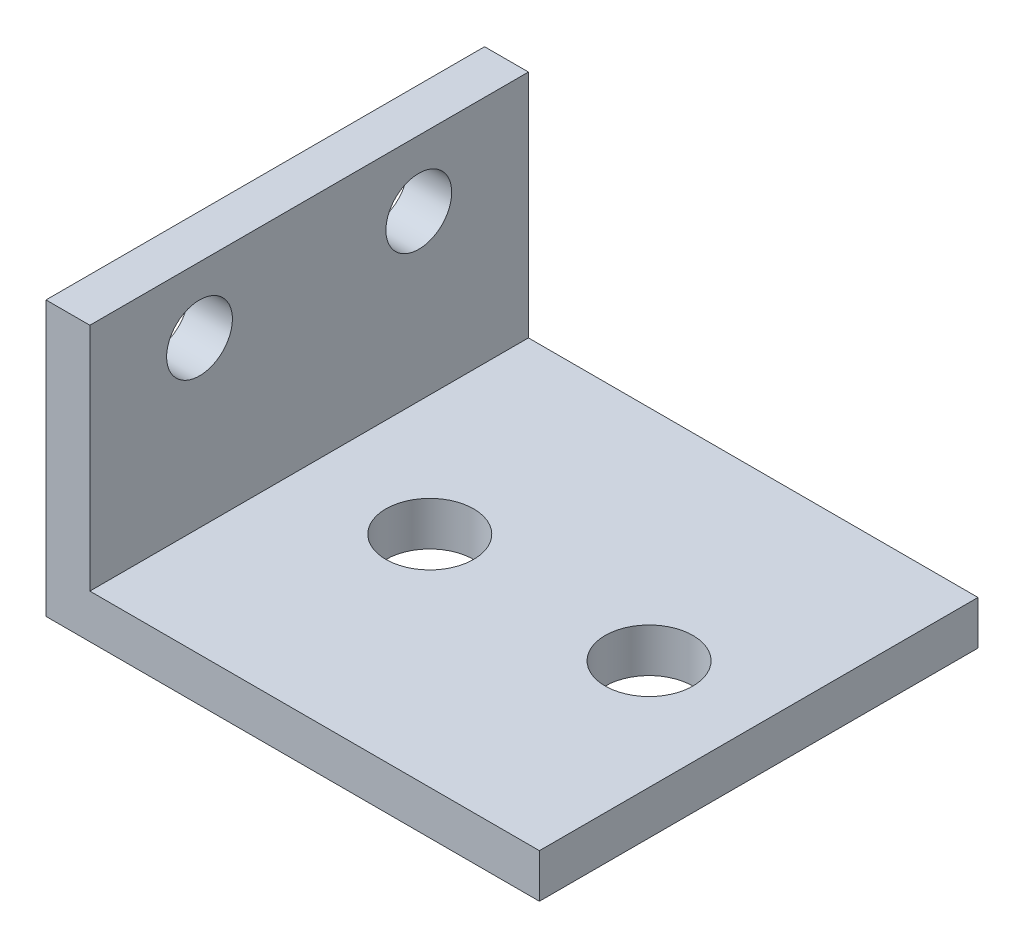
ISO-10303-21;
HEADER;
FILE_DESCRIPTION(('STEP AP214'),'2;1');
FILE_NAME('part.step','',(''),(''),'','','');
FILE_SCHEMA(('AUTOMOTIVE_DESIGN { 1 0 10303 214 1 1 1 1 }'));
ENDSEC;
DATA;
#1=APPLICATION_CONTEXT('core data for automotive mechanical design processes');
#2=APPLICATION_PROTOCOL_DEFINITION('international standard','automotive_design',2000,#1);
#3=PRODUCT_CONTEXT('',#1,'mechanical');
#4=PRODUCT('Part','Part','',(#3));
#5=PRODUCT_RELATED_PRODUCT_CATEGORY('part','',(#4));
#6=PRODUCT_DEFINITION_FORMATION('','',#4);
#7=PRODUCT_DEFINITION_CONTEXT('part definition',#1,'design');
#8=PRODUCT_DEFINITION('design','',#6,#7);
#9=PRODUCT_DEFINITION_SHAPE('','',#8);
#10=(LENGTH_UNIT() NAMED_UNIT(*) SI_UNIT(.MILLI.,.METRE.));
#11=(NAMED_UNIT(*) PLANE_ANGLE_UNIT() SI_UNIT($,.RADIAN.));
#12=(NAMED_UNIT(*) SI_UNIT($,.STERADIAN.) SOLID_ANGLE_UNIT());
#13=UNCERTAINTY_MEASURE_WITH_UNIT(LENGTH_MEASURE(1.E-05),#10,'distance_accuracy_value','');
#14=(GEOMETRIC_REPRESENTATION_CONTEXT(3) GLOBAL_UNCERTAINTY_ASSIGNED_CONTEXT((#13)) GLOBAL_UNIT_ASSIGNED_CONTEXT((#10,
#11,#12)) REPRESENTATION_CONTEXT('',''));
#15=CARTESIAN_POINT('',(0.,0.,0.));
#16=DIRECTION('',(0.,0.,1.));
#17=DIRECTION('',(1.,0.,0.));
#18=AXIS2_PLACEMENT_3D('',#15,#16,#17);
#19=CARTESIAN_POINT('',(45.,0.,40.));
#20=DIRECTION('',(0.,1.,0.));
#21=DIRECTION('',(-1.,0.,0.));
#22=AXIS2_PLACEMENT_3D('',#19,#20,#21);
#23=PLANE('',#22);
#24=CARTESIAN_POINT('',(35.,0.,20.));
#25=DIRECTION('',(0.,1.,0.));
#26=DIRECTION('',(-1.,0.,0.));
#27=AXIS2_PLACEMENT_3D('',#24,#25,#26);
#28=CIRCLE('',#27,4.00000000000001);
#29=CARTESIAN_POINT('',(31.,0.,20.));
#30=VERTEX_POINT('',#29);
#31=EDGE_CURVE('E179',#30,#30,#28,.T.);
#32=ORIENTED_EDGE('',*,*,#31,.T.);
#33=EDGE_LOOP('',(#32));
#34=FACE_BOUND('',#33,.T.);
#35=CARTESIAN_POINT('',(15.,0.,20.));
#36=DIRECTION('',(0.,1.,0.));
#37=DIRECTION('',(-1.,0.,0.));
#38=AXIS2_PLACEMENT_3D('',#35,#36,#37);
#39=CIRCLE('',#38,4.);
#40=CARTESIAN_POINT('',(11.,0.,20.));
#41=VERTEX_POINT('',#40);
#42=EDGE_CURVE('E182',#41,#41,#39,.T.);
#43=ORIENTED_EDGE('',*,*,#42,.T.);
#44=EDGE_LOOP('',(#43));
#45=FACE_BOUND('',#44,.T.);
#46=DIRECTION('',(1.,0.,0.));
#47=VECTOR('',#46,1.);
#48=CARTESIAN_POINT('',(45.,0.,0.));
#49=LINE('',#48,#47);
#50=CARTESIAN_POINT('',(0.,0.,0.));
#51=VERTEX_POINT('',#50);
#52=CARTESIAN_POINT('',(45.,0.,0.));
#53=VERTEX_POINT('',#52);
#54=EDGE_CURVE('E120',#51,#53,#49,.T.);
#55=ORIENTED_EDGE('',*,*,#54,.T.);
#56=DIRECTION('',(0.,0.,-1.));
#57=VECTOR('',#56,1.);
#58=CARTESIAN_POINT('',(45.,0.,40.));
#59=LINE('',#58,#57);
#60=CARTESIAN_POINT('',(45.,0.,40.));
#61=VERTEX_POINT('',#60);
#62=EDGE_CURVE('E11',#61,#53,#59,.T.);
#63=ORIENTED_EDGE('',*,*,#62,.F.);
#64=DIRECTION('',(1.,0.,0.));
#65=VECTOR('',#64,1.);
#66=CARTESIAN_POINT('',(45.,0.,40.));
#67=LINE('',#66,#65);
#68=CARTESIAN_POINT('',(0.,0.,40.));
#69=VERTEX_POINT('',#68);
#70=EDGE_CURVE('E131',#69,#61,#67,.T.);
#71=ORIENTED_EDGE('',*,*,#70,.F.);
#72=DIRECTION('',(0.,0.,-1.));
#73=VECTOR('',#72,1.);
#74=CARTESIAN_POINT('',(0.,0.,40.));
#75=LINE('',#74,#73);
#76=EDGE_CURVE('E116',#69,#51,#75,.T.);
#77=ORIENTED_EDGE('',*,*,#76,.T.);
#78=EDGE_LOOP('',(#55,#63,#71,#77));
#79=FACE_BOUND('',#78,.T.);
#80=ADVANCED_FACE('F34',(#34,#45,#79),#23,.F.);
#81=CARTESIAN_POINT('',(45.,4.,40.));
#82=DIRECTION('',(-1.,0.,0.));
#83=DIRECTION('',(0.,0.,1.));
#84=AXIS2_PLACEMENT_3D('',#81,#82,#83);
#85=PLANE('',#84);
#86=DIRECTION('',(0.,1.,0.));
#87=VECTOR('',#86,1.);
#88=CARTESIAN_POINT('',(45.,4.,0.));
#89=LINE('',#88,#87);
#90=CARTESIAN_POINT('',(45.,4.,0.));
#91=VERTEX_POINT('',#90);
#92=EDGE_CURVE('E123',#53,#91,#89,.T.);
#93=ORIENTED_EDGE('',*,*,#92,.T.);
#94=DIRECTION('',(0.,0.,-1.));
#95=VECTOR('',#94,1.);
#96=CARTESIAN_POINT('',(45.,4.,40.));
#97=LINE('',#96,#95);
#98=CARTESIAN_POINT('',(45.,4.,40.));
#99=VERTEX_POINT('',#98);
#100=EDGE_CURVE('E43',#99,#91,#97,.T.);
#101=ORIENTED_EDGE('',*,*,#100,.F.);
#102=DIRECTION('',(0.,1.,0.));
#103=VECTOR('',#102,1.);
#104=CARTESIAN_POINT('',(45.,4.,40.));
#105=LINE('',#104,#103);
#106=EDGE_CURVE('E89',#61,#99,#105,.T.);
#107=ORIENTED_EDGE('',*,*,#106,.F.);
#108=ORIENTED_EDGE('',*,*,#62,.T.);
#109=EDGE_LOOP('',(#93,#101,#107,#108));
#110=FACE_BOUND('',#109,.T.);
#111=ADVANCED_FACE('F152',(#110),#85,.F.);
#112=CARTESIAN_POINT('',(4.,4.,40.));
#113=DIRECTION('',(0.,-1.,0.));
#114=DIRECTION('',(1.,0.,0.));
#115=AXIS2_PLACEMENT_3D('',#112,#113,#114);
#116=PLANE('',#115);
#117=CARTESIAN_POINT('',(35.,4.,20.));
#118=DIRECTION('',(0.,1.,0.));
#119=DIRECTION('',(-1.,0.,0.));
#120=AXIS2_PLACEMENT_3D('',#117,#118,#119);
#121=CIRCLE('',#120,4.00000000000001);
#122=CARTESIAN_POINT('',(31.,4.,20.));
#123=VERTEX_POINT('',#122);
#124=EDGE_CURVE('E190',#123,#123,#121,.T.);
#125=ORIENTED_EDGE('',*,*,#124,.F.);
#126=EDGE_LOOP('',(#125));
#127=FACE_BOUND('',#126,.T.);
#128=CARTESIAN_POINT('',(15.,4.,20.));
#129=DIRECTION('',(0.,1.,0.));
#130=DIRECTION('',(-1.,0.,0.));
#131=AXIS2_PLACEMENT_3D('',#128,#129,#130);
#132=CIRCLE('',#131,4.);
#133=CARTESIAN_POINT('',(11.,4.,20.));
#134=VERTEX_POINT('',#133);
#135=EDGE_CURVE('E184',#134,#134,#132,.T.);
#136=ORIENTED_EDGE('',*,*,#135,.F.);
#137=EDGE_LOOP('',(#136));
#138=FACE_BOUND('',#137,.T.);
#139=DIRECTION('',(-1.,0.,0.));
#140=VECTOR('',#139,1.);
#141=CARTESIAN_POINT('',(4.,4.,0.));
#142=LINE('',#141,#140);
#143=CARTESIAN_POINT('',(4.,4.,0.));
#144=VERTEX_POINT('',#143);
#145=EDGE_CURVE('E126',#91,#144,#142,.T.);
#146=ORIENTED_EDGE('',*,*,#145,.T.);
#147=DIRECTION('',(0.,0.,-1.));
#148=VECTOR('',#147,1.);
#149=CARTESIAN_POINT('',(4.,4.,40.));
#150=LINE('',#149,#148);
#151=CARTESIAN_POINT('',(4.,4.,40.));
#152=VERTEX_POINT('',#151);
#153=EDGE_CURVE('E111',#152,#144,#150,.T.);
#154=ORIENTED_EDGE('',*,*,#153,.F.);
#155=DIRECTION('',(-1.,0.,0.));
#156=VECTOR('',#155,1.);
#157=CARTESIAN_POINT('',(4.,4.,40.));
#158=LINE('',#157,#156);
#159=EDGE_CURVE('E102',#99,#152,#158,.T.);
#160=ORIENTED_EDGE('',*,*,#159,.F.);
#161=ORIENTED_EDGE('',*,*,#100,.T.);
#162=EDGE_LOOP('',(#146,#154,#160,#161));
#163=FACE_BOUND('',#162,.T.);
#164=ADVANCED_FACE('F155',(#127,#138,#163),#116,.F.);
#165=CARTESIAN_POINT('',(4.,25.,40.));
#166=DIRECTION('',(-1.,0.,0.));
#167=DIRECTION('',(0.,-1.,0.));
#168=AXIS2_PLACEMENT_3D('',#165,#166,#167);
#169=PLANE('',#168);
#170=CARTESIAN_POINT('',(4.,19.,10.));
#171=DIRECTION('',(1.,0.,0.));
#172=DIRECTION('',(0.,1.,0.));
#173=AXIS2_PLACEMENT_3D('',#170,#171,#172);
#174=CIRCLE('',#173,3.);
#175=CARTESIAN_POINT('',(4.,22.,10.));
#176=VERTEX_POINT('',#175);
#177=EDGE_CURVE('E145',#176,#176,#174,.T.);
#178=ORIENTED_EDGE('',*,*,#177,.F.);
#179=EDGE_LOOP('',(#178));
#180=FACE_BOUND('',#179,.T.);
#181=CARTESIAN_POINT('',(4.,19.,30.));
#182=DIRECTION('',(1.,0.,0.));
#183=DIRECTION('',(0.,1.,0.));
#184=AXIS2_PLACEMENT_3D('',#181,#182,#183);
#185=CIRCLE('',#184,3.);
#186=CARTESIAN_POINT('',(4.,22.,30.));
#187=VERTEX_POINT('',#186);
#188=EDGE_CURVE('E137',#187,#187,#185,.T.);
#189=ORIENTED_EDGE('',*,*,#188,.F.);
#190=EDGE_LOOP('',(#189));
#191=FACE_BOUND('',#190,.T.);
#192=DIRECTION('',(0.,1.,0.));
#193=VECTOR('',#192,1.);
#194=CARTESIAN_POINT('',(4.,25.,0.));
#195=LINE('',#194,#193);
#196=CARTESIAN_POINT('',(4.,25.,0.));
#197=VERTEX_POINT('',#196);
#198=EDGE_CURVE('E110',#144,#197,#195,.T.);
#199=ORIENTED_EDGE('',*,*,#198,.T.);
#200=DIRECTION('',(0.,0.,-1.));
#201=VECTOR('',#200,1.);
#202=CARTESIAN_POINT('',(4.,25.,40.));
#203=LINE('',#202,#201);
#204=CARTESIAN_POINT('',(4.,25.,40.));
#205=VERTEX_POINT('',#204);
#206=EDGE_CURVE('E107',#205,#197,#203,.T.);
#207=ORIENTED_EDGE('',*,*,#206,.F.);
#208=DIRECTION('',(0.,1.,0.));
#209=VECTOR('',#208,1.);
#210=CARTESIAN_POINT('',(4.,25.,40.));
#211=LINE('',#210,#209);
#212=EDGE_CURVE('E96',#152,#205,#211,.T.);
#213=ORIENTED_EDGE('',*,*,#212,.F.);
#214=ORIENTED_EDGE('',*,*,#153,.T.);
#215=EDGE_LOOP('',(#199,#207,#213,#214));
#216=FACE_BOUND('',#215,.T.);
#217=ADVANCED_FACE('F108',(#180,#191,#216),#169,.F.);
#218=CARTESIAN_POINT('',(0.,25.,40.));
#219=DIRECTION('',(0.,-1.,0.));
#220=DIRECTION('',(0.,0.,-1.));
#221=AXIS2_PLACEMENT_3D('',#218,#219,#220);
#222=PLANE('',#221);
#223=DIRECTION('',(-1.,0.,0.));
#224=VECTOR('',#223,1.);
#225=CARTESIAN_POINT('',(0.,25.,0.));
#226=LINE('',#225,#224);
#227=CARTESIAN_POINT('',(0.,25.,0.));
#228=VERTEX_POINT('',#227);
#229=EDGE_CURVE('E75',#197,#228,#226,.T.);
#230=ORIENTED_EDGE('',*,*,#229,.T.);
#231=DIRECTION('',(0.,0.,-1.));
#232=VECTOR('',#231,1.);
#233=CARTESIAN_POINT('',(0.,25.,40.));
#234=LINE('',#233,#232);
#235=CARTESIAN_POINT('',(0.,25.,40.));
#236=VERTEX_POINT('',#235);
#237=EDGE_CURVE('E112',#236,#228,#234,.T.);
#238=ORIENTED_EDGE('',*,*,#237,.F.);
#239=DIRECTION('',(-1.,0.,0.));
#240=VECTOR('',#239,1.);
#241=CARTESIAN_POINT('',(0.,25.,40.));
#242=LINE('',#241,#240);
#243=EDGE_CURVE('E100',#205,#236,#242,.T.);
#244=ORIENTED_EDGE('',*,*,#243,.F.);
#245=ORIENTED_EDGE('',*,*,#206,.T.);
#246=EDGE_LOOP('',(#230,#238,#244,#245));
#247=FACE_BOUND('',#246,.T.);
#248=ADVANCED_FACE('F114',(#247),#222,.F.);
#249=CARTESIAN_POINT('',(0.,0.,40.));
#250=DIRECTION('',(1.,0.,0.));
#251=DIRECTION('',(0.,0.,-1.));
#252=AXIS2_PLACEMENT_3D('',#249,#250,#251);
#253=PLANE('',#252);
#254=CARTESIAN_POINT('',(0.,19.,10.));
#255=DIRECTION('',(1.,0.,0.));
#256=DIRECTION('',(0.,0.,-1.));
#257=AXIS2_PLACEMENT_3D('',#254,#255,#256);
#258=CIRCLE('',#257,3.);
#259=CARTESIAN_POINT('',(0.,19.,7.));
#260=VERTEX_POINT('',#259);
#261=EDGE_CURVE('E37',#260,#260,#258,.T.);
#262=ORIENTED_EDGE('',*,*,#261,.T.);
#263=EDGE_LOOP('',(#262));
#264=FACE_BOUND('',#263,.T.);
#265=CARTESIAN_POINT('',(0.,19.,30.));
#266=DIRECTION('',(1.,0.,0.));
#267=DIRECTION('',(0.,0.,-1.));
#268=AXIS2_PLACEMENT_3D('',#265,#266,#267);
#269=CIRCLE('',#268,3.);
#270=CARTESIAN_POINT('',(0.,19.,27.));
#271=VERTEX_POINT('',#270);
#272=EDGE_CURVE('E124',#271,#271,#269,.T.);
#273=ORIENTED_EDGE('',*,*,#272,.T.);
#274=EDGE_LOOP('',(#273));
#275=FACE_BOUND('',#274,.T.);
#276=DIRECTION('',(0.,-1.,0.));
#277=VECTOR('',#276,1.);
#278=CARTESIAN_POINT('',(0.,0.,0.));
#279=LINE('',#278,#277);
#280=EDGE_CURVE('E81',#228,#51,#279,.T.);
#281=ORIENTED_EDGE('',*,*,#280,.T.);
#282=ORIENTED_EDGE('',*,*,#76,.F.);
#283=DIRECTION('',(0.,-1.,0.));
#284=VECTOR('',#283,1.);
#285=CARTESIAN_POINT('',(0.,0.,40.));
#286=LINE('',#285,#284);
#287=EDGE_CURVE('E52',#236,#69,#286,.T.);
#288=ORIENTED_EDGE('',*,*,#287,.F.);
#289=ORIENTED_EDGE('',*,*,#237,.T.);
#290=EDGE_LOOP('',(#281,#282,#288,#289));
#291=FACE_BOUND('',#290,.T.);
#292=ADVANCED_FACE('F160',(#264,#275,#291),#253,.F.);
#293=CARTESIAN_POINT('',(0.,0.,40.));
#294=DIRECTION('',(0.,0.,-1.));
#295=DIRECTION('',(-1.,0.,0.));
#296=AXIS2_PLACEMENT_3D('',#293,#294,#295);
#297=PLANE('',#296);
#298=ORIENTED_EDGE('',*,*,#70,.T.);
#299=ORIENTED_EDGE('',*,*,#106,.T.);
#300=ORIENTED_EDGE('',*,*,#159,.T.);
#301=ORIENTED_EDGE('',*,*,#212,.T.);
#302=ORIENTED_EDGE('',*,*,#243,.T.);
#303=ORIENTED_EDGE('',*,*,#287,.T.);
#304=EDGE_LOOP('',(#298,#299,#300,#301,#302,#303));
#305=FACE_BOUND('',#304,.T.);
#306=ADVANCED_FACE('F98',(#305),#297,.F.);
#307=CARTESIAN_POINT('',(0.,0.,0.));
#308=DIRECTION('',(0.,0.,-1.));
#309=DIRECTION('',(-1.,0.,0.));
#310=AXIS2_PLACEMENT_3D('',#307,#308,#309);
#311=PLANE('',#310);
#312=ORIENTED_EDGE('',*,*,#54,.F.);
#313=ORIENTED_EDGE('',*,*,#280,.F.);
#314=ORIENTED_EDGE('',*,*,#229,.F.);
#315=ORIENTED_EDGE('',*,*,#198,.F.);
#316=ORIENTED_EDGE('',*,*,#145,.F.);
#317=ORIENTED_EDGE('',*,*,#92,.F.);
#318=EDGE_LOOP('',(#312,#313,#314,#315,#316,#317));
#319=FACE_BOUND('',#318,.T.);
#320=ADVANCED_FACE('F158',(#319),#311,.T.);
#321=CARTESIAN_POINT('',(-36.,19.,30.));
#322=DIRECTION('',(1.,0.,0.));
#323=DIRECTION('',(0.,1.,0.));
#324=AXIS2_PLACEMENT_3D('',#321,#322,#323);
#325=CYLINDRICAL_SURFACE('',#324,3.);
#326=ORIENTED_EDGE('',*,*,#188,.T.);
#327=EDGE_LOOP('',(#326));
#328=FACE_BOUND('',#327,.T.);
#329=ORIENTED_EDGE('',*,*,#272,.F.);
#330=EDGE_LOOP('',(#329));
#331=FACE_BOUND('',#330,.T.);
#332=ADVANCED_FACE('F211',(#328,#331),#325,.F.);
#333=CARTESIAN_POINT('',(-36.,19.,10.));
#334=DIRECTION('',(1.,0.,0.));
#335=DIRECTION('',(0.,1.,0.));
#336=AXIS2_PLACEMENT_3D('',#333,#334,#335);
#337=CYLINDRICAL_SURFACE('',#336,3.);
#338=ORIENTED_EDGE('',*,*,#177,.T.);
#339=EDGE_LOOP('',(#338));
#340=FACE_BOUND('',#339,.T.);
#341=ORIENTED_EDGE('',*,*,#261,.F.);
#342=EDGE_LOOP('',(#341));
#343=FACE_BOUND('',#342,.T.);
#344=ADVANCED_FACE('F204',(#340,#343),#337,.F.);
#345=CARTESIAN_POINT('',(15.,-36.,20.));
#346=DIRECTION('',(0.,1.,0.));
#347=DIRECTION('',(-1.,0.,0.));
#348=AXIS2_PLACEMENT_3D('',#345,#346,#347);
#349=CYLINDRICAL_SURFACE('',#348,4.);
#350=ORIENTED_EDGE('',*,*,#135,.T.);
#351=EDGE_LOOP('',(#350));
#352=FACE_BOUND('',#351,.T.);
#353=ORIENTED_EDGE('',*,*,#42,.F.);
#354=EDGE_LOOP('',(#353));
#355=FACE_BOUND('',#354,.T.);
#356=ADVANCED_FACE('F202',(#352,#355),#349,.F.);
#357=CARTESIAN_POINT('',(35.,-36.,20.));
#358=DIRECTION('',(0.,1.,0.));
#359=DIRECTION('',(-1.,0.,0.));
#360=AXIS2_PLACEMENT_3D('',#357,#358,#359);
#361=CYLINDRICAL_SURFACE('',#360,4.00000000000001);
#362=ORIENTED_EDGE('',*,*,#124,.T.);
#363=EDGE_LOOP('',(#362));
#364=FACE_BOUND('',#363,.T.);
#365=ORIENTED_EDGE('',*,*,#31,.F.);
#366=EDGE_LOOP('',(#365));
#367=FACE_BOUND('',#366,.T.);
#368=ADVANCED_FACE('F194',(#364,#367),#361,.F.);
#369=CLOSED_SHELL('',(#80,#111,#164,#217,#248,#292,#306,#320,#332,#344,#356,#368));
#370=MANIFOLD_SOLID_BREP('B2',#369);
#371=ADVANCED_BREP_SHAPE_REPRESENTATION('',(#18,#370),#14);
#372=SHAPE_DEFINITION_REPRESENTATION(#9,#371);
ENDSEC;
END-ISO-10303-21;
